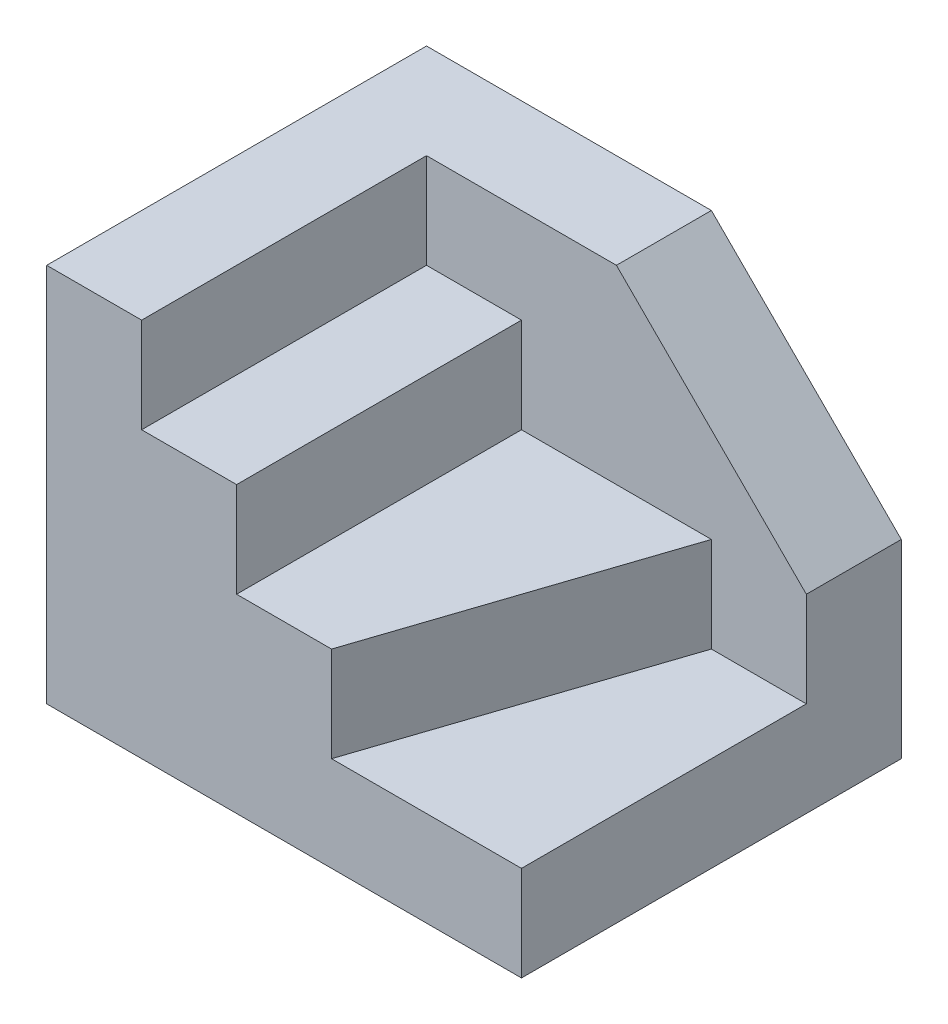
from build123d import *

# Parameters (mm, degrees)
EXTRUDE3_DEPTH = 40
SKETCH_W       = 10
SKETCH_H       = 30
EXTRUDE4_DEPTH = 30
EXTRUDE5_DEPTH = 20
EXTRUDE6_DEPTH = 10
CHAMFER2_SIZE  = 20


with BuildPart() as part:
    # Sketch4 → Extrude3 (new body)
    with BuildSketch(Plane(origin=(0, 0, 0), x_dir=(1, 0, 0), z_dir=(0, 1, 0))):
        Polygon((0, 0), (10, 0), (10, 30), (20, 30), (40, 30), (50, 30), (50, 40), (0, 40), align=None)
    extrude(amount=EXTRUDE3_DEPTH)

    # Sketch → Extrude4 (add)
    with BuildSketch(Plane(origin=(0, 0, 0), x_dir=(1, 0, 0), z_dir=(0, 1, 0))):
        with Locations((15, 15)):
            Rectangle(SKETCH_W, SKETCH_H)
    extrude(amount=EXTRUDE4_DEPTH)

    # Sketch 2 → Extrude5 (add)
    with BuildSketch(Plane(origin=(0, 0, 0), x_dir=(1, 0, 0), z_dir=(0, 1, 0))):
        Polygon((20, 30), (20, 0), (30, 0), (40, 30), align=None)
    extrude(amount=EXTRUDE5_DEPTH)

    # Sketch 3 → Extrude6 (add)
    with BuildSketch(Plane(origin=(0, 0, 0), x_dir=(1, 0, 0), z_dir=(0, 1, 0))):
        Polygon((40, 30), (30, 0), (50, 0), (50, 30), align=None)
    extrude(amount=EXTRUDE6_DEPTH)

    # Chamfer2
    chamfer2_edges = [part.edges().sort_by_distance(p)[0] for p in [
        (50, 40, -35),
    ]]
    chamfer(chamfer2_edges, length=CHAMFER2_SIZE)


solid = part.part
